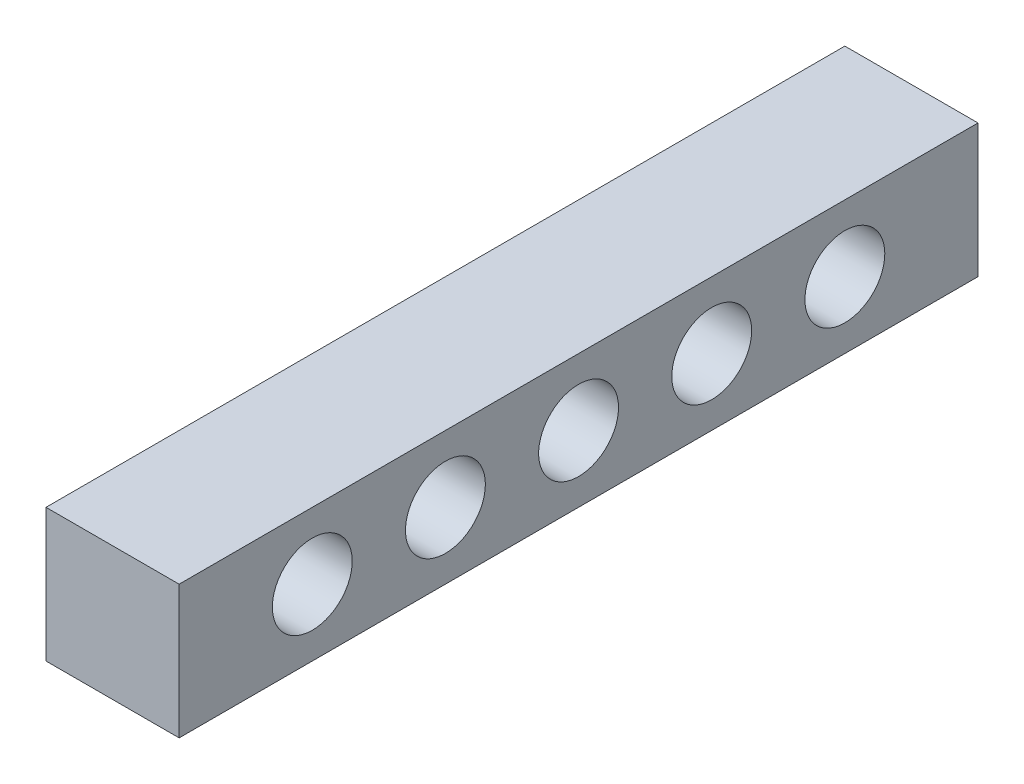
from build123d import *

# Parameters (mm, degrees)
SKETCH1_W           = 60
SKETCH1_H           = 10
BOSS_EXTRUDE2_DEPTH = 10
SKETCH3_R           = 3
CUT_EXTRUDE1_DEPTH  = 33.015621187


with BuildPart() as part:
    # Sketch1 → Boss-Extrude2 (new body)
    with BuildSketch(Plane(origin=(0, 0, 0), x_dir=(0, 0, -1), z_dir=(1, 0, 0))):
        Rectangle(SKETCH1_W, SKETCH1_H)
    extrude(amount=BOSS_EXTRUDE2_DEPTH)

    # Sketch3 → Cut-Extrude1 (cut, through all)
    with BuildSketch(Plane(origin=(10, 0, 0), x_dir=(0, 0, -1), z_dir=(1, 0, 0))):
        Circle(SKETCH3_R)
        with Locations((-10, 0)):
            Circle(SKETCH3_R)
        with Locations((-20, 0)):
            Circle(SKETCH3_R)
        with Locations((10, 0)):
            Circle(SKETCH3_R)
        with Locations((20, 0)):
            Circle(SKETCH3_R)
    extrude(amount=-CUT_EXTRUDE1_DEPTH, mode=Mode.SUBTRACT)


solid = part.part
